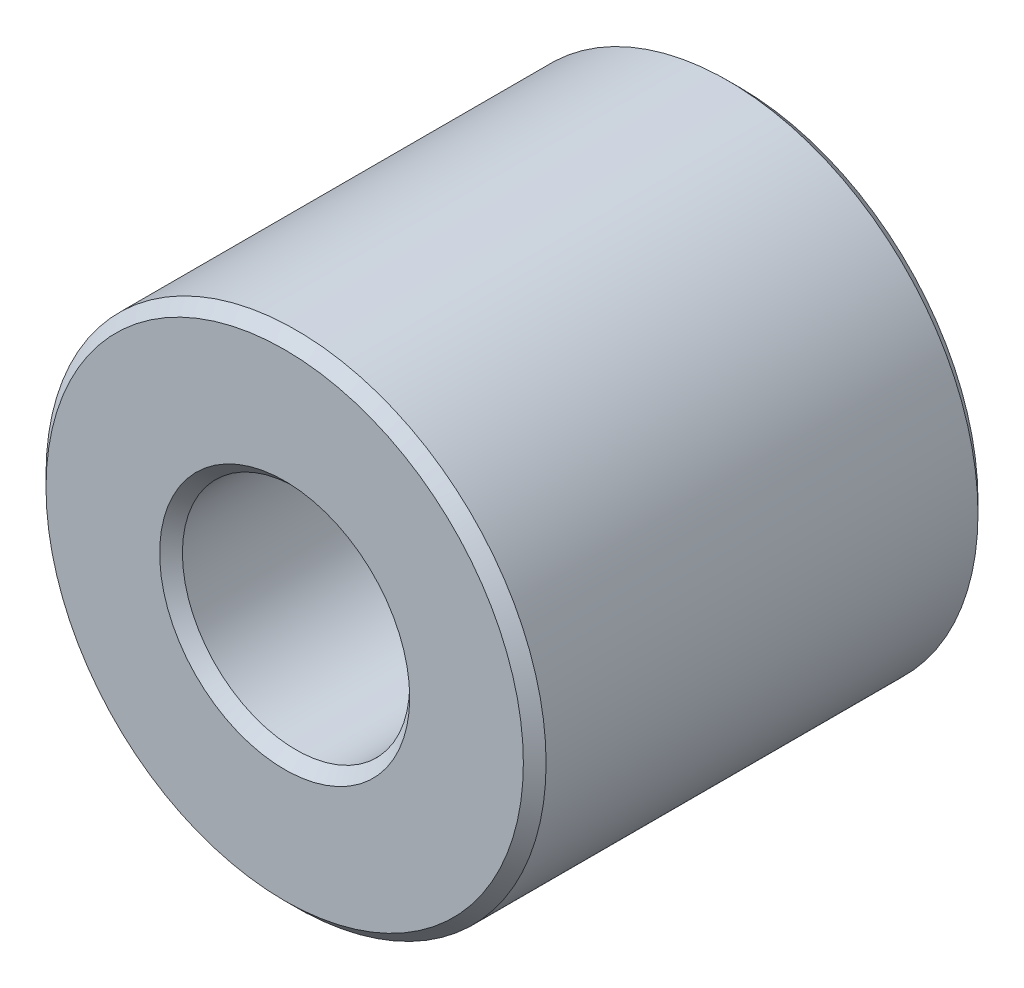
ISO-10303-21;
HEADER;
FILE_DESCRIPTION(('STEP AP214'),'2;1');
FILE_NAME('part.step','',(''),(''),'','','');
FILE_SCHEMA(('AUTOMOTIVE_DESIGN { 1 0 10303 214 1 1 1 1 }'));
ENDSEC;
DATA;
#1=APPLICATION_CONTEXT('core data for automotive mechanical design processes');
#2=APPLICATION_PROTOCOL_DEFINITION('international standard','automotive_design',2000,#1);
#3=PRODUCT_CONTEXT('',#1,'mechanical');
#4=PRODUCT('Part','Part','',(#3));
#5=PRODUCT_RELATED_PRODUCT_CATEGORY('part','',(#4));
#6=PRODUCT_DEFINITION_FORMATION('','',#4);
#7=PRODUCT_DEFINITION_CONTEXT('part definition',#1,'design');
#8=PRODUCT_DEFINITION('design','',#6,#7);
#9=PRODUCT_DEFINITION_SHAPE('','',#8);
#10=(LENGTH_UNIT() NAMED_UNIT(*) SI_UNIT(.MILLI.,.METRE.));
#11=(NAMED_UNIT(*) PLANE_ANGLE_UNIT() SI_UNIT($,.RADIAN.));
#12=(NAMED_UNIT(*) SI_UNIT($,.STERADIAN.) SOLID_ANGLE_UNIT());
#13=UNCERTAINTY_MEASURE_WITH_UNIT(LENGTH_MEASURE(1.E-05),#10,'distance_accuracy_value','');
#14=(GEOMETRIC_REPRESENTATION_CONTEXT(3) GLOBAL_UNCERTAINTY_ASSIGNED_CONTEXT((#13)) GLOBAL_UNIT_ASSIGNED_CONTEXT((#10,
#11,#12)) REPRESENTATION_CONTEXT('',''));
#15=CARTESIAN_POINT('',(0.,0.,0.));
#16=DIRECTION('',(0.,0.,1.));
#17=DIRECTION('',(1.,0.,0.));
#18=AXIS2_PLACEMENT_3D('',#15,#16,#17);
#19=CARTESIAN_POINT('',(0.,0.,10.));
#20=DIRECTION('',(0.,0.,1.));
#21=DIRECTION('',(1.,0.,0.));
#22=AXIS2_PLACEMENT_3D('',#19,#20,#21);
#23=PLANE('',#22);
#24=CARTESIAN_POINT('',(0.,0.,10.));
#25=DIRECTION('',(0.,0.,1.));
#26=DIRECTION('',(1.,0.,0.));
#27=AXIS2_PLACEMENT_3D('',#24,#25,#26);
#28=CIRCLE('',#27,5.50000000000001);
#29=CARTESIAN_POINT('',(5.50000000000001,0.,10.));
#30=VERTEX_POINT('',#29);
#31=EDGE_CURVE('E10',#30,#30,#28,.F.);
#32=ORIENTED_EDGE('',*,*,#31,.T.);
#33=EDGE_LOOP('',(#32));
#34=FACE_BOUND('',#33,.T.);
#35=CARTESIAN_POINT('',(0.,0.,10.));
#36=DIRECTION('',(0.,0.,1.));
#37=DIRECTION('',(1.,0.,0.));
#38=AXIS2_PLACEMENT_3D('',#35,#36,#37);
#39=CIRCLE('',#38,10.5);
#40=CARTESIAN_POINT('',(10.5,0.,10.));
#41=VERTEX_POINT('',#40);
#42=EDGE_CURVE('E39',#41,#41,#39,.T.);
#43=ORIENTED_EDGE('',*,*,#42,.T.);
#44=EDGE_LOOP('',(#43));
#45=FACE_BOUND('',#44,.T.);
#46=ADVANCED_FACE('F32',(#34,#45),#23,.T.);
#47=CARTESIAN_POINT('',(0.,0.,-10.));
#48=DIRECTION('',(0.,0.,1.));
#49=DIRECTION('',(1.,0.,0.));
#50=AXIS2_PLACEMENT_3D('',#47,#48,#49);
#51=PLANE('',#50);
#52=CARTESIAN_POINT('',(0.,0.,-10.));
#53=DIRECTION('',(0.,0.,1.));
#54=DIRECTION('',(1.,0.,0.));
#55=AXIS2_PLACEMENT_3D('',#52,#53,#54);
#56=CIRCLE('',#55,5.5);
#57=CARTESIAN_POINT('',(5.5,0.,-10.));
#58=VERTEX_POINT('',#57);
#59=EDGE_CURVE('E58',#58,#58,#56,.T.);
#60=ORIENTED_EDGE('',*,*,#59,.T.);
#61=EDGE_LOOP('',(#60));
#62=FACE_BOUND('',#61,.T.);
#63=CARTESIAN_POINT('',(0.,0.,-10.));
#64=DIRECTION('',(0.,0.,1.));
#65=DIRECTION('',(1.,0.,0.));
#66=AXIS2_PLACEMENT_3D('',#63,#64,#65);
#67=CIRCLE('',#66,10.5);
#68=CARTESIAN_POINT('',(10.5,0.,-10.));
#69=VERTEX_POINT('',#68);
#70=EDGE_CURVE('E61',#69,#69,#67,.F.);
#71=ORIENTED_EDGE('',*,*,#70,.T.);
#72=EDGE_LOOP('',(#71));
#73=FACE_BOUND('',#72,.T.);
#74=ADVANCED_FACE('F65',(#62,#73),#51,.F.);
#75=CARTESIAN_POINT('',(0.,0.,10.));
#76=DIRECTION('',(0.,0.,-1.));
#77=DIRECTION('',(-1.,0.,0.));
#78=AXIS2_PLACEMENT_3D('',#75,#76,#77);
#79=CYLINDRICAL_SURFACE('',#78,11.);
#80=CARTESIAN_POINT('',(0.,0.,-9.5));
#81=DIRECTION('',(0.,0.,1.));
#82=DIRECTION('',(1.,0.,0.));
#83=AXIS2_PLACEMENT_3D('',#80,#81,#82);
#84=CIRCLE('',#83,11.);
#85=CARTESIAN_POINT('',(11.,0.,-9.5));
#86=VERTEX_POINT('',#85);
#87=EDGE_CURVE('E43',#86,#86,#84,.T.);
#88=ORIENTED_EDGE('',*,*,#87,.T.);
#89=EDGE_LOOP('',(#88));
#90=FACE_BOUND('',#89,.T.);
#91=CARTESIAN_POINT('',(0.,0.,9.49999999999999));
#92=DIRECTION('',(0.,0.,1.));
#93=DIRECTION('',(1.,0.,0.));
#94=AXIS2_PLACEMENT_3D('',#91,#92,#93);
#95=CIRCLE('',#94,11.);
#96=CARTESIAN_POINT('',(11.,0.,9.49999999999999));
#97=VERTEX_POINT('',#96);
#98=EDGE_CURVE('E47',#97,#97,#95,.F.);
#99=ORIENTED_EDGE('',*,*,#98,.T.);
#100=EDGE_LOOP('',(#99));
#101=FACE_BOUND('',#100,.T.);
#102=ADVANCED_FACE('F75',(#90,#101),#79,.T.);
#103=CARTESIAN_POINT('',(0.,0.,10.));
#104=DIRECTION('',(0.,0.,-1.));
#105=DIRECTION('',(-1.,0.,0.));
#106=AXIS2_PLACEMENT_3D('',#103,#104,#105);
#107=CYLINDRICAL_SURFACE('',#106,5.);
#108=CARTESIAN_POINT('',(0.,0.,-9.5));
#109=DIRECTION('',(0.,0.,1.));
#110=DIRECTION('',(1.,0.,0.));
#111=AXIS2_PLACEMENT_3D('',#108,#109,#110);
#112=CIRCLE('',#111,5.);
#113=CARTESIAN_POINT('',(5.,0.,-9.5));
#114=VERTEX_POINT('',#113);
#115=EDGE_CURVE('E52',#114,#114,#112,.F.);
#116=ORIENTED_EDGE('',*,*,#115,.T.);
#117=EDGE_LOOP('',(#116));
#118=FACE_BOUND('',#117,.T.);
#119=CARTESIAN_POINT('',(0.,0.,9.49999999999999));
#120=DIRECTION('',(0.,0.,1.));
#121=DIRECTION('',(1.,0.,0.));
#122=AXIS2_PLACEMENT_3D('',#119,#120,#121);
#123=CIRCLE('',#122,5.);
#124=CARTESIAN_POINT('',(5.,0.,9.49999999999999));
#125=VERTEX_POINT('',#124);
#126=EDGE_CURVE('E55',#125,#125,#123,.T.);
#127=ORIENTED_EDGE('',*,*,#126,.T.);
#128=EDGE_LOOP('',(#127));
#129=FACE_BOUND('',#128,.T.);
#130=ADVANCED_FACE('F78',(#118,#129),#107,.F.);
#131=CARTESIAN_POINT('',(0.,0.,-10.));
#132=DIRECTION('',(0.,0.,-1.));
#133=DIRECTION('',(-1.,0.,0.));
#134=AXIS2_PLACEMENT_3D('',#131,#132,#133);
#135=CONICAL_SURFACE('',#134,5.5,0.785398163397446);
#136=ORIENTED_EDGE('',*,*,#115,.F.);
#137=EDGE_LOOP('',(#136));
#138=FACE_BOUND('',#137,.T.);
#139=ORIENTED_EDGE('',*,*,#59,.F.);
#140=EDGE_LOOP('',(#139));
#141=FACE_BOUND('',#140,.T.);
#142=ADVANCED_FACE('F71',(#138,#141),#135,.F.);
#143=CARTESIAN_POINT('',(0.,0.,-9.5));
#144=DIRECTION('',(0.,0.,1.));
#145=DIRECTION('',(1.,0.,0.));
#146=AXIS2_PLACEMENT_3D('',#143,#144,#145);
#147=CONICAL_SURFACE('',#146,11.,0.785398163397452);
#148=ORIENTED_EDGE('',*,*,#70,.F.);
#149=EDGE_LOOP('',(#148));
#150=FACE_BOUND('',#149,.T.);
#151=ORIENTED_EDGE('',*,*,#87,.F.);
#152=EDGE_LOOP('',(#151));
#153=FACE_BOUND('',#152,.T.);
#154=ADVANCED_FACE('F67',(#150,#153),#147,.T.);
#155=CARTESIAN_POINT('',(0.,0.,9.49999999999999));
#156=DIRECTION('',(0.,0.,1.));
#157=DIRECTION('',(1.,0.,0.));
#158=AXIS2_PLACEMENT_3D('',#155,#156,#157);
#159=CONICAL_SURFACE('',#158,5.,0.785398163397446);
#160=ORIENTED_EDGE('',*,*,#31,.F.);
#161=EDGE_LOOP('',(#160));
#162=FACE_BOUND('',#161,.T.);
#163=ORIENTED_EDGE('',*,*,#126,.F.);
#164=EDGE_LOOP('',(#163));
#165=FACE_BOUND('',#164,.T.);
#166=ADVANCED_FACE('F70',(#162,#165),#159,.F.);
#167=CARTESIAN_POINT('',(0.,0.,10.));
#168=DIRECTION('',(0.,0.,-1.));
#169=DIRECTION('',(-1.,0.,0.));
#170=AXIS2_PLACEMENT_3D('',#167,#168,#169);
#171=CONICAL_SURFACE('',#170,10.5,0.785398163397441);
#172=ORIENTED_EDGE('',*,*,#98,.F.);
#173=EDGE_LOOP('',(#172));
#174=FACE_BOUND('',#173,.T.);
#175=ORIENTED_EDGE('',*,*,#42,.F.);
#176=EDGE_LOOP('',(#175));
#177=FACE_BOUND('',#176,.T.);
#178=ADVANCED_FACE('F34',(#174,#177),#171,.T.);
#179=CLOSED_SHELL('',(#46,#74,#102,#130,#142,#154,#166,#178));
#180=MANIFOLD_SOLID_BREP('B2',#179);
#181=ADVANCED_BREP_SHAPE_REPRESENTATION('',(#18,#180),#14);
#182=SHAPE_DEFINITION_REPRESENTATION(#9,#181);
ENDSEC;
END-ISO-10303-21;
